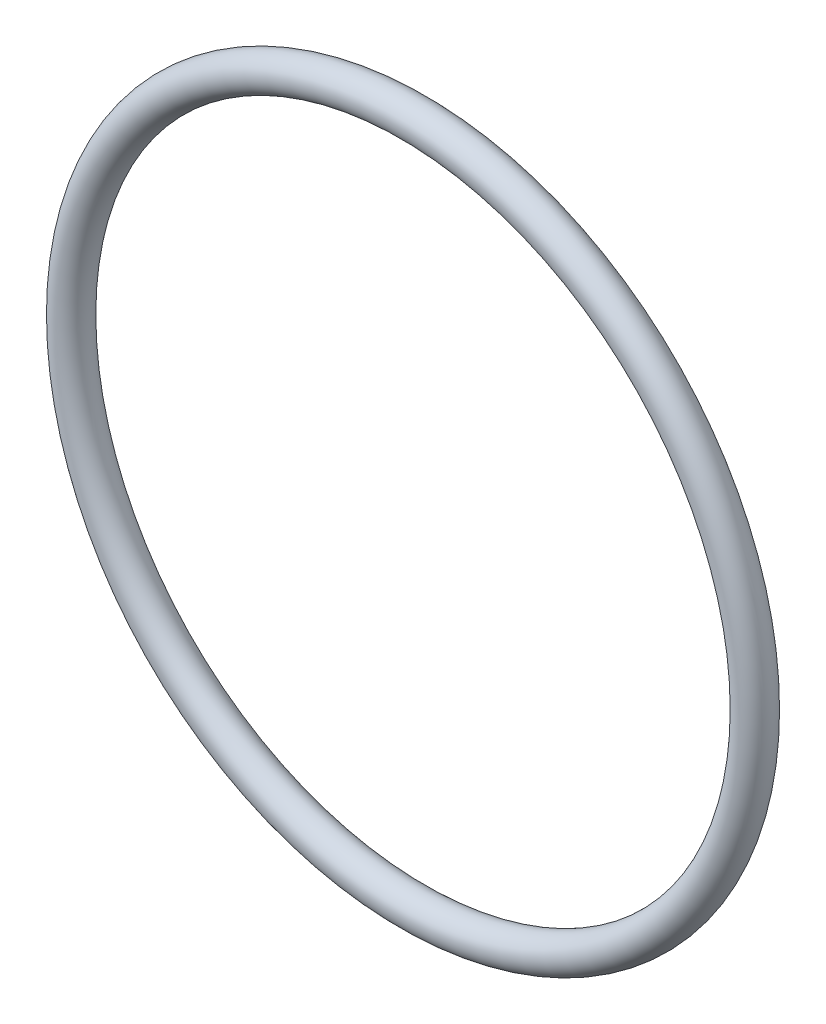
from build123d import *

# Parameters (mm, degrees)
SKETCH1_R = 0.889


with BuildPart() as part:
    # Sketch1 → Revolve1 (revolve)
    with BuildSketch(Plane(origin=(0, 0, 0), x_dir=(0, 0, -1), z_dir=(1, 0, 0)), mode=Mode.PRIVATE) as revolve1_sk:
        with Locations((0, 17.4117)):
            Circle(SKETCH1_R)
    revolve(revolve1_sk.sketch.rotate(Axis((0, 0, 0), (0, 0, -1)), 90), axis=Axis((0, 0, 0), (0, 0, -1)))


solid = part.part
